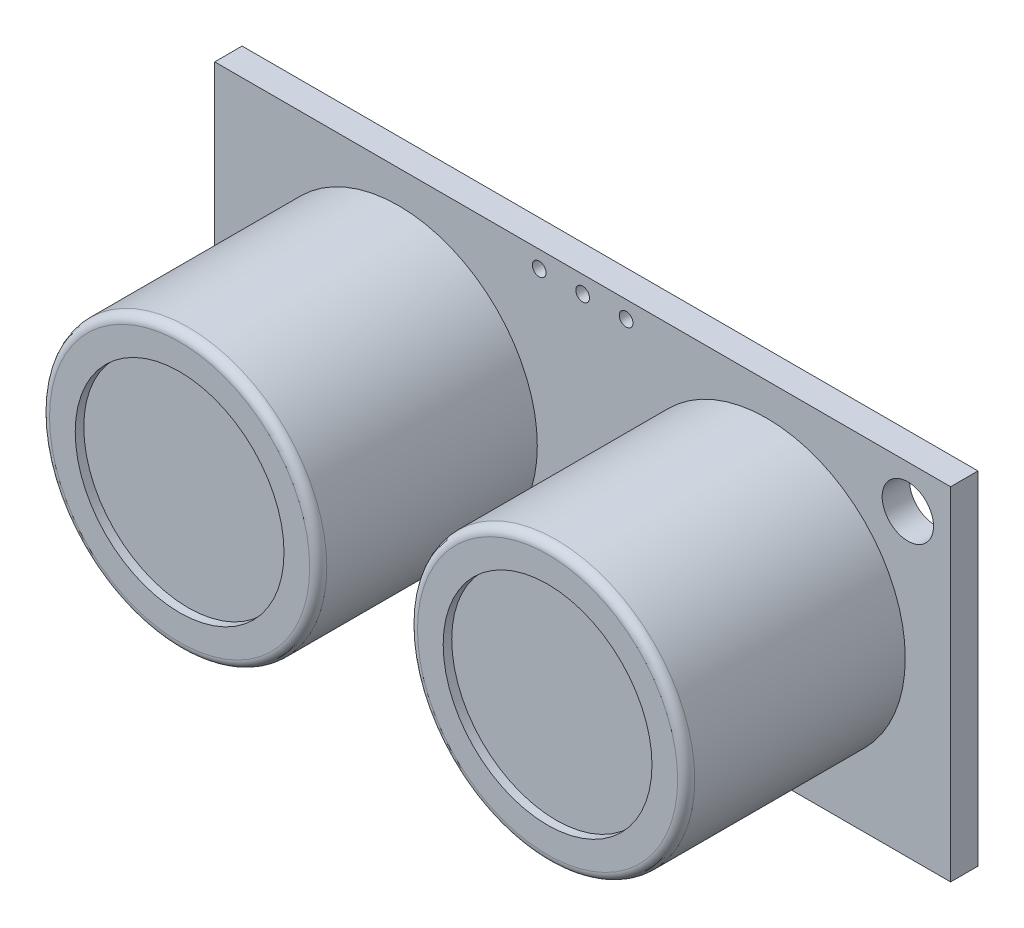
from build123d import *

# Parameters (mm, degrees)
ESQUISSE1_W             = 43
ESQUISSE1_H             = 20
ESQUISSE1_R             = 1.5
ESQUISSE1_R_2           = 0.4
EXTRUSION1_DEPTH        = 1.6
ESQUISSE2_R             = 8.1
EXTRUSION2_DEPTH        = 12.8
ESQUISSE3_R             = 6.1
ENL_V_MAT_EXTRU_1_DEPTH = 0.5
CONG_1_R                = 0.5
CONG_1_OF_SYM_TRIE1_R   = 0.5


with BuildPart() as part:
    # Esquisse1 → Extrusion1 (new body)
    with BuildSketch(Plane.XY):
        with Locations((21.5, 10)):
            Rectangle(ESQUISSE1_W, ESQUISSE1_H)
        with Locations((2.5, 2.5)):
            Circle(ESQUISSE1_R, mode=Mode.SUBTRACT)
        with Locations((21.5, 19)):
            Circle(ESQUISSE1_R_2, mode=Mode.SUBTRACT)
        with Locations((40.5, 17.5)):
            Circle(ESQUISSE1_R, mode=Mode.SUBTRACT)
        with Locations((18.96, 19)):
            Circle(ESQUISSE1_R_2, mode=Mode.SUBTRACT)
        with Locations(Location((24.04, 19, 0), (0, 0, 180))):
            Circle(ESQUISSE1_R_2, mode=Mode.SUBTRACT)
    extrude(amount=EXTRUSION1_DEPTH)

    # Esquisse2 → Extrusion2 (add)
    with BuildSketch(Plane.XY.offset(1.6)):
        with Locations(Location((32.25, 10, 0), (0, 0, 180))):
            Circle(ESQUISSE2_R)
    extrusion2 = extrude(amount=EXTRUSION2_DEPTH)

    # Esquisse3 → Enl_v. mat.-Extru.1 (cut)
    with BuildSketch(Plane.XY.offset(14.4)):
        with Locations((32.25, 10)):
            Circle(ESQUISSE3_R)
    enl_v_mat_extru_1 = extrude(amount=-ENL_V_MAT_EXTRU_1_DEPTH, mode=Mode.SUBTRACT)

    # Cong_1
    cong_1_edges = [part.edges().sort_by_distance(p)[0] for p in [
        (40.35, 10, 14.4),
    ]]
    fillet(cong_1_edges, radius=CONG_1_R)

    # Sym_trie1: Extrusion2, Enl_v. mat.-Extru.1 across plane
    add(extrusion2.mirror(Plane(origin=(21.5, 0, 0), x_dir=(0, 0, 1), z_dir=(1, 0, 0))))
    add(enl_v_mat_extru_1.mirror(Plane(origin=(21.5, 0, 0), x_dir=(0, 0, 1), z_dir=(1, 0, 0))), mode=Mode.SUBTRACT)

    # Cong_1 of Sym_trie1
    cong_1_of_sym_trie1_edges = [part.edges().sort_by_distance(p)[0] for p in [
        (2.65, 10, 14.4),
    ]]
    fillet(cong_1_of_sym_trie1_edges, radius=CONG_1_OF_SYM_TRIE1_R)


solid = part.part
